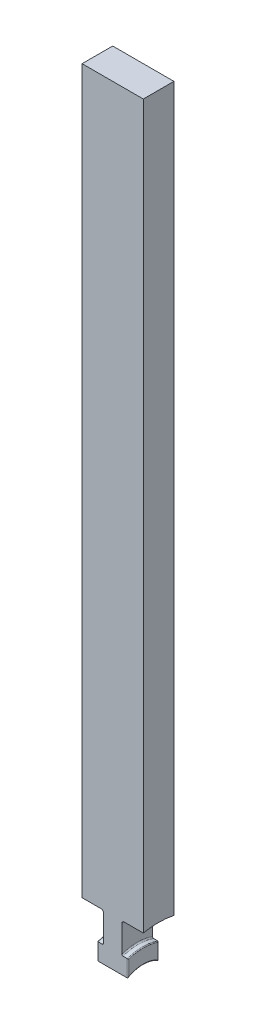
ISO-10303-21;
HEADER;
FILE_DESCRIPTION(('STEP AP214'),'2;1');
FILE_NAME('part.step','',(''),(''),'','','');
FILE_SCHEMA(('AUTOMOTIVE_DESIGN { 1 0 10303 214 1 1 1 1 }'));
ENDSEC;
DATA;
#1=APPLICATION_CONTEXT('core data for automotive mechanical design processes');
#2=APPLICATION_PROTOCOL_DEFINITION('international standard','automotive_design',2000,#1);
#3=PRODUCT_CONTEXT('',#1,'mechanical');
#4=PRODUCT('Part','Part','',(#3));
#5=PRODUCT_RELATED_PRODUCT_CATEGORY('part','',(#4));
#6=PRODUCT_DEFINITION_FORMATION('','',#4);
#7=PRODUCT_DEFINITION_CONTEXT('part definition',#1,'design');
#8=PRODUCT_DEFINITION('design','',#6,#7);
#9=PRODUCT_DEFINITION_SHAPE('','',#8);
#10=(LENGTH_UNIT() NAMED_UNIT(*) SI_UNIT(.MILLI.,.METRE.));
#11=(NAMED_UNIT(*) PLANE_ANGLE_UNIT() SI_UNIT($,.RADIAN.));
#12=(NAMED_UNIT(*) SI_UNIT($,.STERADIAN.) SOLID_ANGLE_UNIT());
#13=UNCERTAINTY_MEASURE_WITH_UNIT(LENGTH_MEASURE(1.E-05),#10,'distance_accuracy_value','');
#14=(GEOMETRIC_REPRESENTATION_CONTEXT(3) GLOBAL_UNCERTAINTY_ASSIGNED_CONTEXT((#13)) GLOBAL_UNIT_ASSIGNED_CONTEXT((#10,
#11,#12)) REPRESENTATION_CONTEXT('',''));
#15=CARTESIAN_POINT('',(0.,0.,0.));
#16=DIRECTION('',(0.,0.,1.));
#17=DIRECTION('',(1.,0.,0.));
#18=AXIS2_PLACEMENT_3D('',#15,#16,#17);
#19=CARTESIAN_POINT('',(10.,260.,5.));
#20=DIRECTION('',(0.,0.,-1.));
#21=DIRECTION('',(0.,1.,0.));
#22=AXIS2_PLACEMENT_3D('',#19,#20,#21);
#23=PLANE('',#22);
#24=DIRECTION('',(-1.,0.,0.));
#25=VECTOR('',#24,1.);
#26=CARTESIAN_POINT('',(-8.84822894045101,14.142135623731,4.99999999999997));
#27=LINE('',#26,#25);
#28=CARTESIAN_POINT('',(-4.75,14.142135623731,4.99999999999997));
#29=VERTEX_POINT('',#28);
#30=CARTESIAN_POINT('',(-3.381,14.142135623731,4.99999999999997));
#31=VERTEX_POINT('',#30);
#32=EDGE_CURVE('E731',#29,#31,#27,.F.);
#33=ORIENTED_EDGE('',*,*,#32,.F.);
#34=DIRECTION('',(0.,1.,0.));
#35=VECTOR('',#34,1.);
#36=CARTESIAN_POINT('',(-4.75000000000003,260.,5.));
#37=LINE('',#36,#35);
#38=CARTESIAN_POINT('',(-4.75,8.6602540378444,4.99999999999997));
#39=VERTEX_POINT('',#38);
#40=EDGE_CURVE('E442',#29,#39,#37,.F.);
#41=ORIENTED_EDGE('',*,*,#40,.T.);
#42=DIRECTION('',(1.,0.,0.));
#43=VECTOR('',#42,1.);
#44=CARTESIAN_POINT('',(-10.,8.6602540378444,4.99999999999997));
#45=LINE('',#44,#43);
#46=CARTESIAN_POINT('',(4.75,8.6602540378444,4.99999999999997));
#47=VERTEX_POINT('',#46);
#48=EDGE_CURVE('E212',#39,#47,#45,.T.);
#49=ORIENTED_EDGE('',*,*,#48,.T.);
#50=DIRECTION('',(0.,-1.,0.));
#51=VECTOR('',#50,1.);
#52=CARTESIAN_POINT('',(4.74999999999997,260.,5.));
#53=LINE('',#52,#51);
#54=CARTESIAN_POINT('',(4.75,14.142135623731,4.99999999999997));
#55=VERTEX_POINT('',#54);
#56=EDGE_CURVE('E440',#47,#55,#53,.F.);
#57=ORIENTED_EDGE('',*,*,#56,.T.);
#58=DIRECTION('',(-1.,0.,0.));
#59=VECTOR('',#58,1.);
#60=CARTESIAN_POINT('',(-8.84822894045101,14.142135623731,4.99999999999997));
#61=LINE('',#60,#59);
#62=CARTESIAN_POINT('',(3.381,14.142135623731,4.99999999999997));
#63=VERTEX_POINT('',#62);
#64=EDGE_CURVE('E734',#63,#55,#61,.F.);
#65=ORIENTED_EDGE('',*,*,#64,.F.);
#66=CARTESIAN_POINT('',(3.381,14.142135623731,4.99999999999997));
#67=CARTESIAN_POINT('',(3.36044101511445,14.1421123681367,4.99999999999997));
#68=CARTESIAN_POINT('',(3.33989480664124,14.1438990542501,4.99999999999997));
#69=CARTESIAN_POINT('',(3.29944640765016,14.150911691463,4.99999999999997));
#70=CARTESIAN_POINT('',(3.27954279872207,14.1561294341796,4.99999999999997));
#71=CARTESIAN_POINT('',(3.24089644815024,14.1698244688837,4.99999999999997));
#72=CARTESIAN_POINT('',(3.22215359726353,14.1783014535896,4.99999999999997));
#73=CARTESIAN_POINT('',(3.18630692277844,14.1982079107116,4.99999999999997));
#74=CARTESIAN_POINT('',(3.16920356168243,14.2096382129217,4.99999999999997));
#75=CARTESIAN_POINT('',(3.13665043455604,14.2353899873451,4.99999999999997));
#76=CARTESIAN_POINT('',(3.12125112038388,14.2497751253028,4.99999999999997));
#77=CARTESIAN_POINT('',(3.09293401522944,14.2808084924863,4.99999999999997));
#78=CARTESIAN_POINT('',(3.08001687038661,14.2974573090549,4.99999999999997));
#79=CARTESIAN_POINT('',(3.05629123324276,14.3335018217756,4.99999999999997));
#80=CARTESIAN_POINT('',(3.0456345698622,14.3529973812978,4.99999999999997));
#81=CARTESIAN_POINT('',(3.02756329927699,14.393438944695,4.99999999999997));
#82=CARTESIAN_POINT('',(3.02014920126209,14.4143851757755,4.99999999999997));
#83=CARTESIAN_POINT('',(3.00963126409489,14.4536794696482,4.99999999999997));
#84=CARTESIAN_POINT('',(3.00602178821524,14.4718944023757,4.99999999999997));
#85=CARTESIAN_POINT('',(3.00120597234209,14.5086131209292,4.99999999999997));
#86=CARTESIAN_POINT('',(2.99999624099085,14.5271164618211,4.99999999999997));
#87=CARTESIAN_POINT('',(3.,14.5456234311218,4.99999999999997));
#88=B_SPLINE_CURVE_WITH_KNOTS('',3,(#66,#67,#68,#69,#70,#71,#72,#73,#74,#75,#76,#77,#78,#79,#80,
#81,#82,#83,#84,#85,#86,#87),.UNSPECIFIED.,.F.,.F.,(4,2,2,2,2,2,2,2,2,2,4),(0.,
0.061579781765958,0.123012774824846,0.18443997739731,0.245884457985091,0.308826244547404,
0.371784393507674,0.438147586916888,0.504521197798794,0.560074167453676,0.615548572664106),.UNSPECIFIED.);
#89=CARTESIAN_POINT('',(3.,14.5456234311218,4.99999999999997));
#90=VERTEX_POINT('',#89);
#91=EDGE_CURVE('E312',#63,#90,#88,.T.);
#92=ORIENTED_EDGE('',*,*,#91,.T.);
#93=DIRECTION('',(0.,-1.,0.));
#94=VECTOR('',#93,1.);
#95=CARTESIAN_POINT('',(3.,260.,5.));
#96=LINE('',#95,#94);
#97=CARTESIAN_POINT('',(3.,23.2054442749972,4.99999999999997));
#98=VERTEX_POINT('',#97);
#99=EDGE_CURVE('E464',#98,#90,#96,.T.);
#100=ORIENTED_EDGE('',*,*,#99,.F.);
#101=CARTESIAN_POINT('',(3.,23.2054442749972,4.99999999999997));
#102=CARTESIAN_POINT('',(2.99996676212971,23.2499972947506,4.99999999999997));
#103=CARTESIAN_POINT('',(3.00373228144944,23.2945461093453,4.99999999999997));
#104=CARTESIAN_POINT('',(3.01862949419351,23.3823910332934,4.99999999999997));
#105=CARTESIAN_POINT('',(3.02976052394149,23.4256872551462,4.99999999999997));
#106=CARTESIAN_POINT('',(3.05916829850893,23.509822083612,4.99999999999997));
#107=CARTESIAN_POINT('',(3.07745028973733,23.5506588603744,4.99999999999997));
#108=CARTESIAN_POINT('',(3.12067837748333,23.6286229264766,4.99999999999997));
#109=CARTESIAN_POINT('',(3.14562195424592,23.6657516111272,4.99999999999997));
#110=CARTESIAN_POINT('',(3.2012013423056,23.7347915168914,4.99999999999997));
#111=CARTESIAN_POINT('',(3.23177053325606,23.7667563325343,4.99999999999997));
#112=CARTESIAN_POINT('',(3.29795305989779,23.8249730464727,4.99999999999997));
#113=CARTESIAN_POINT('',(3.33356714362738,23.8512240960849,4.99999999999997));
#114=CARTESIAN_POINT('',(3.40801970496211,23.8966720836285,4.99999999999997));
#115=CARTESIAN_POINT('',(3.44677552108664,23.9160046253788,4.99999999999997));
#116=CARTESIAN_POINT('',(3.5270132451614,23.9477326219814,4.99999999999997));
#117=CARTESIAN_POINT('',(3.56849266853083,23.9601343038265,4.99999999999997));
#118=CARTESIAN_POINT('',(3.63558702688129,23.9740235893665,4.99999999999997));
#119=CARTESIAN_POINT('',(3.66073087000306,23.9779013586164,4.99999999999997));
#120=CARTESIAN_POINT('',(3.71124579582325,23.9830736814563,4.99999999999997));
#121=CARTESIAN_POINT('',(3.7366164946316,23.9843719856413,4.99999999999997));
#122=CARTESIAN_POINT('',(3.762,23.9843699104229,4.99999999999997));
#123=B_SPLINE_CURVE_WITH_KNOTS('',3,(#101,#102,#103,#104,#105,#106,#107,#108,#109,#110,#111,
#112,#113,#114,#115,#116,#117,#118,#119,#120,#121,#122),.UNSPECIFIED.,.F.,.F.,(4,2,2,2,2,2,2,2,
2,2,4),(0.,0.133495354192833,0.266978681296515,0.40056012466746,0.53409111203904,
0.6661321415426,0.798192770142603,0.927501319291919,1.05669350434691,1.13289667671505,
1.20898896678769),.UNSPECIFIED.);
#124=CARTESIAN_POINT('',(3.762,23.9843699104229,4.99999999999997));
#125=VERTEX_POINT('',#124);
#126=EDGE_CURVE('E277',#98,#125,#123,.T.);
#127=ORIENTED_EDGE('',*,*,#126,.T.);
#128=DIRECTION('',(-1.,0.,0.));
#129=VECTOR('',#128,1.);
#130=CARTESIAN_POINT('',(-8.84822894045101,23.9843699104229,4.99999999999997));
#131=LINE('',#130,#129);
#132=CARTESIAN_POINT('',(10.,23.9843699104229,4.99999999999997));
#133=VERTEX_POINT('',#132);
#134=EDGE_CURVE('E741',#133,#125,#131,.T.);
#135=ORIENTED_EDGE('',*,*,#134,.F.);
#136=DIRECTION('',(0.,-1.,0.));
#137=VECTOR('',#136,1.);
#138=CARTESIAN_POINT('',(10.,260.,5.));
#139=LINE('',#138,#137);
#140=CARTESIAN_POINT('',(10.,260.,5.));
#141=VERTEX_POINT('',#140);
#142=EDGE_CURVE('E470',#141,#133,#139,.T.);
#143=ORIENTED_EDGE('',*,*,#142,.F.);
#144=DIRECTION('',(-1.,0.,0.));
#145=VECTOR('',#144,1.);
#146=CARTESIAN_POINT('',(10.,260.,5.));
#147=LINE('',#146,#145);
#148=CARTESIAN_POINT('',(-10.,260.,5.));
#149=VERTEX_POINT('',#148);
#150=EDGE_CURVE('E206',#141,#149,#147,.T.);
#151=ORIENTED_EDGE('',*,*,#150,.T.);
#152=DIRECTION('',(0.,-1.,0.));
#153=VECTOR('',#152,1.);
#154=CARTESIAN_POINT('',(-10.,260.,5.));
#155=LINE('',#154,#153);
#156=CARTESIAN_POINT('',(-10.,23.9843699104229,4.99999999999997));
#157=VERTEX_POINT('',#156);
#158=EDGE_CURVE('E198',#149,#157,#155,.T.);
#159=ORIENTED_EDGE('',*,*,#158,.T.);
#160=DIRECTION('',(-1.,0.,0.));
#161=VECTOR('',#160,1.);
#162=CARTESIAN_POINT('',(-8.84822894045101,23.9843699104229,4.99999999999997));
#163=LINE('',#162,#161);
#164=CARTESIAN_POINT('',(-3.762,23.9843699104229,4.99999999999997));
#165=VERTEX_POINT('',#164);
#166=EDGE_CURVE('E179',#165,#157,#163,.T.);
#167=ORIENTED_EDGE('',*,*,#166,.F.);
#168=CARTESIAN_POINT('',(-3.762,23.9843699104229,4.99999999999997));
#169=CARTESIAN_POINT('',(-3.71978958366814,23.9844099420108,4.99999999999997));
#170=CARTESIAN_POINT('',(-3.67759522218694,23.9807897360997,4.99999999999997));
#171=CARTESIAN_POINT('',(-3.59446661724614,23.9665304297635,4.99999999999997));
#172=CARTESIAN_POINT('',(-3.55353072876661,23.9559009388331,4.99999999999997));
#173=CARTESIAN_POINT('',(-3.47401404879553,23.9279192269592,4.99999999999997));
#174=CARTESIAN_POINT('',(-3.4354339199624,23.9105651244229,4.99999999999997));
#175=CARTESIAN_POINT('',(-3.36170074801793,23.8696860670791,4.99999999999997));
#176=CARTESIAN_POINT('',(-3.32654766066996,23.846161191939,4.99999999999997));
#177=CARTESIAN_POINT('',(-3.26030425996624,23.7934071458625,4.99999999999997));
#178=CARTESIAN_POINT('',(-3.22925316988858,23.7641287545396,4.99999999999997));
#179=CARTESIAN_POINT('',(-3.17238517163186,23.7008610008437,4.99999999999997));
#180=CARTESIAN_POINT('',(-3.14656943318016,23.6668705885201,4.99999999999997));
#181=CARTESIAN_POINT('',(-3.10035493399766,23.5944221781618,4.99999999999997));
#182=CARTESIAN_POINT('',(-3.0800757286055,23.5558879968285,4.99999999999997));
#183=CARTESIAN_POINT('',(-3.04613526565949,23.4760125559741,4.99999999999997));
#184=CARTESIAN_POINT('',(-3.03247223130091,23.4346720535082,4.99999999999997));
#185=CARTESIAN_POINT('',(-3.01487304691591,23.3618958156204,4.99999999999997));
#186=CARTESIAN_POINT('',(-3.0092983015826,23.3308452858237,4.99999999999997));
#187=CARTESIAN_POINT('',(-3.00186183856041,23.2683479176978,4.99999999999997));
#188=CARTESIAN_POINT('',(-2.9999948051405,23.2369017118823,4.99999999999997));
#189=CARTESIAN_POINT('',(-3.,23.2054442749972,4.99999999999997));
#190=B_SPLINE_CURVE_WITH_KNOTS('',3,(#168,#169,#170,#171,#172,#173,#174,#175,#176,#177,#178,
#179,#180,#181,#182,#183,#184,#185,#186,#187,#188,#189),.UNSPECIFIED.,.F.,.F.,(4,2,2,2,2,2,2,2,
2,2,4),(0.,0.126452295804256,0.25273158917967,0.379046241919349,0.50535926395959,
0.632804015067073,0.760277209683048,0.89031743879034,1.02032272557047,1.11475319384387,
1.20904817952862),.UNSPECIFIED.);
#191=CARTESIAN_POINT('',(-3.,23.2054442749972,4.99999999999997));
#192=VERTEX_POINT('',#191);
#193=EDGE_CURVE('E243',#165,#192,#190,.T.);
#194=ORIENTED_EDGE('',*,*,#193,.T.);
#195=DIRECTION('',(0.,1.,0.));
#196=VECTOR('',#195,1.);
#197=CARTESIAN_POINT('',(-3.,260.,5.));
#198=LINE('',#197,#196);
#199=CARTESIAN_POINT('',(-3.,14.5456234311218,4.99999999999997));
#200=VERTEX_POINT('',#199);
#201=EDGE_CURVE('E732',#200,#192,#198,.T.);
#202=ORIENTED_EDGE('',*,*,#201,.F.);
#203=CARTESIAN_POINT('',(-3.,14.5456234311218,4.99999999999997));
#204=CARTESIAN_POINT('',(-2.99998669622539,14.521929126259,4.99999999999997));
#205=CARTESIAN_POINT('',(-3.00197620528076,14.4982335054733,4.99999999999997));
#206=CARTESIAN_POINT('',(-3.00986486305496,14.4514801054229,4.99999999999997));
#207=CARTESIAN_POINT('',(-3.01576760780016,14.4284229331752,4.99999999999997));
#208=CARTESIAN_POINT('',(-3.03139415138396,14.3836107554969,4.99999999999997));
#209=CARTESIAN_POINT('',(-3.04112173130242,14.3618570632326,4.99999999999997));
#210=CARTESIAN_POINT('',(-3.06418438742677,14.3203644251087,4.99999999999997));
#211=CARTESIAN_POINT('',(-3.07751717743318,14.3006242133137,4.99999999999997));
#212=CARTESIAN_POINT('',(-3.10707013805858,14.2643232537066,4.99999999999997));
#213=CARTESIAN_POINT('',(-3.12320168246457,14.2476904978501,4.99999999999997));
#214=CARTESIAN_POINT('',(-3.15817938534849,14.2175591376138,4.99999999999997));
#215=CARTESIAN_POINT('',(-3.17702556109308,14.2040605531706,4.99999999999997));
#216=CARTESIAN_POINT('',(-3.21576938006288,14.1813954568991,4.99999999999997));
#217=CARTESIAN_POINT('',(-3.23555118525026,14.1720306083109,4.99999999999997));
#218=CARTESIAN_POINT('',(-3.27645260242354,14.1569716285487,4.99999999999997));
#219=CARTESIAN_POINT('',(-3.29757019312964,14.1512720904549,4.99999999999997));
#220=CARTESIAN_POINT('',(-3.32924424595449,14.145729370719,4.99999999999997));
#221=CARTESIAN_POINT('',(-3.33955687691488,14.1443822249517,4.99999999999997));
#222=CARTESIAN_POINT('',(-3.36024450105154,14.1425859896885,4.99999999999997));
#223=CARTESIAN_POINT('',(-3.37061937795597,14.1421355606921,4.99999999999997));
#224=CARTESIAN_POINT('',(-3.38099999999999,14.1421356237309,4.99999999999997));
#225=B_SPLINE_CURVE_WITH_KNOTS('',3,(#203,#204,#205,#206,#207,#208,#209,#210,#211,#212,#213,
#214,#215,#216,#217,#218,#219,#220,#221,#222,#223,#224),.UNSPECIFIED.,.F.,.F.,(4,2,2,2,2,2,2,2,
2,2,4),(0.,0.0710029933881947,0.14207132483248,0.213210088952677,0.284303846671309,
0.353459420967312,0.422615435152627,0.487945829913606,0.553179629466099,0.584346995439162,
0.615467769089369),.UNSPECIFIED.);
#226=EDGE_CURVE('E292',#200,#31,#225,.T.);
#227=ORIENTED_EDGE('',*,*,#226,.T.);
#228=EDGE_LOOP('',(#33,#41,#49,#57,#65,#92,#100,#127,#135,#143,#151,#159,#167,#194,#202,#227));
#229=FACE_BOUND('',#228,.T.);
#230=ADVANCED_FACE('F37',(#229),#23,.F.);
#231=CARTESIAN_POINT('',(10.,260.,-5.));
#232=DIRECTION('',(0.,0.,1.));
#233=DIRECTION('',(0.,-1.,0.));
#234=AXIS2_PLACEMENT_3D('',#231,#232,#233);
#235=PLANE('',#234);
#236=DIRECTION('',(1.,0.,0.));
#237=VECTOR('',#236,1.);
#238=CARTESIAN_POINT('',(-10.,8.66025403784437,-5.00000000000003));
#239=LINE('',#238,#237);
#240=CARTESIAN_POINT('',(4.75,8.66025403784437,-5.00000000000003));
#241=VERTEX_POINT('',#240);
#242=CARTESIAN_POINT('',(-4.75,8.66025403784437,-5.00000000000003));
#243=VERTEX_POINT('',#242);
#244=EDGE_CURVE('E462',#241,#243,#239,.F.);
#245=ORIENTED_EDGE('',*,*,#244,.T.);
#246=DIRECTION('',(0.,1.,0.));
#247=VECTOR('',#246,1.);
#248=CARTESIAN_POINT('',(-4.75000000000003,260.,-5.));
#249=LINE('',#248,#247);
#250=CARTESIAN_POINT('',(-4.75,14.1421356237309,-5.00000000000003));
#251=VERTEX_POINT('',#250);
#252=EDGE_CURVE('E432',#243,#251,#249,.T.);
#253=ORIENTED_EDGE('',*,*,#252,.T.);
#254=DIRECTION('',(-1.,0.,0.));
#255=VECTOR('',#254,1.);
#256=CARTESIAN_POINT('',(-8.84822894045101,14.1421356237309,-5.00000000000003));
#257=LINE('',#256,#255);
#258=CARTESIAN_POINT('',(-3.381,14.1421356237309,-5.00000000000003));
#259=VERTEX_POINT('',#258);
#260=EDGE_CURVE('E747',#259,#251,#257,.T.);
#261=ORIENTED_EDGE('',*,*,#260,.F.);
#262=CARTESIAN_POINT('',(-3.381,14.1421356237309,-5.00000000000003));
#263=CARTESIAN_POINT('',(-3.36044101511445,14.1421123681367,-5.00000000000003));
#264=CARTESIAN_POINT('',(-3.33989480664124,14.1438990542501,-5.00000000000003));
#265=CARTESIAN_POINT('',(-3.29944640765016,14.150911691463,-5.00000000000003));
#266=CARTESIAN_POINT('',(-3.27954279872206,14.1561294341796,-5.00000000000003));
#267=CARTESIAN_POINT('',(-3.24089644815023,14.1698244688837,-5.00000000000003));
#268=CARTESIAN_POINT('',(-3.22215359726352,14.1783014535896,-5.00000000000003));
#269=CARTESIAN_POINT('',(-3.18630692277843,14.1982079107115,-5.00000000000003));
#270=CARTESIAN_POINT('',(-3.16920356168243,14.2096382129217,-5.00000000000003));
#271=CARTESIAN_POINT('',(-3.13665043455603,14.2353899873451,-5.00000000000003));
#272=CARTESIAN_POINT('',(-3.12125112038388,14.2497751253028,-5.00000000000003));
#273=CARTESIAN_POINT('',(-3.09293401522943,14.2808084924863,-5.00000000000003));
#274=CARTESIAN_POINT('',(-3.08001687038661,14.2974573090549,-5.00000000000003));
#275=CARTESIAN_POINT('',(-3.05629123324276,14.3335018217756,-5.00000000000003));
#276=CARTESIAN_POINT('',(-3.0456345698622,14.3529973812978,-5.00000000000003));
#277=CARTESIAN_POINT('',(-3.02756329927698,14.3934389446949,-5.00000000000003));
#278=CARTESIAN_POINT('',(-3.02014920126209,14.4143851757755,-5.00000000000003));
#279=CARTESIAN_POINT('',(-3.00963126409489,14.4536794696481,-5.00000000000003));
#280=CARTESIAN_POINT('',(-3.00602178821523,14.4718944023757,-5.00000000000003));
#281=CARTESIAN_POINT('',(-3.00120597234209,14.5086131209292,-5.00000000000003));
#282=CARTESIAN_POINT('',(-2.99999624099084,14.5271164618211,-5.00000000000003));
#283=CARTESIAN_POINT('',(-3.,14.5456234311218,-5.00000000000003));
#284=B_SPLINE_CURVE_WITH_KNOTS('',3,(#262,#263,#264,#265,#266,#267,#268,#269,#270,#271,#272,
#273,#274,#275,#276,#277,#278,#279,#280,#281,#282,#283),.UNSPECIFIED.,.F.,.F.,(4,2,2,2,2,2,2,2,
2,2,4),(0.,0.0615797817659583,0.123012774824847,0.184439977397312,0.245884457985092,
0.308826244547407,0.371784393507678,0.43814758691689,0.504521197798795,0.56007416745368,
0.615548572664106),.UNSPECIFIED.);
#285=CARTESIAN_POINT('',(-3.,14.5456234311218,-5.00000000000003));
#286=VERTEX_POINT('',#285);
#287=EDGE_CURVE('E301',#259,#286,#284,.T.);
#288=ORIENTED_EDGE('',*,*,#287,.T.);
#289=DIRECTION('',(0.,-1.,0.));
#290=VECTOR('',#289,1.);
#291=CARTESIAN_POINT('',(-3.,260.,-5.));
#292=LINE('',#291,#290);
#293=CARTESIAN_POINT('',(-3.,23.2054442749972,-5.00000000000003));
#294=VERTEX_POINT('',#293);
#295=EDGE_CURVE('E221',#294,#286,#292,.T.);
#296=ORIENTED_EDGE('',*,*,#295,.F.);
#297=CARTESIAN_POINT('',(-3.,23.2054442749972,-5.00000000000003));
#298=CARTESIAN_POINT('',(-2.99996676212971,23.2499972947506,-5.00000000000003));
#299=CARTESIAN_POINT('',(-3.00373228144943,23.2945461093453,-5.00000000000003));
#300=CARTESIAN_POINT('',(-3.01862949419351,23.3823910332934,-5.00000000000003));
#301=CARTESIAN_POINT('',(-3.02976052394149,23.4256872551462,-5.00000000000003));
#302=CARTESIAN_POINT('',(-3.05916829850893,23.509822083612,-5.00000000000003));
#303=CARTESIAN_POINT('',(-3.07745028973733,23.5506588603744,-5.00000000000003));
#304=CARTESIAN_POINT('',(-3.12067837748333,23.6286229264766,-5.00000000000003));
#305=CARTESIAN_POINT('',(-3.14562195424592,23.6657516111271,-5.00000000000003));
#306=CARTESIAN_POINT('',(-3.2012013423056,23.7347915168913,-5.00000000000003));
#307=CARTESIAN_POINT('',(-3.23177053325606,23.7667563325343,-5.00000000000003));
#308=CARTESIAN_POINT('',(-3.29795305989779,23.8249730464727,-5.00000000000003));
#309=CARTESIAN_POINT('',(-3.33356714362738,23.8512240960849,-5.00000000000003));
#310=CARTESIAN_POINT('',(-3.40801970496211,23.8966720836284,-5.00000000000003));
#311=CARTESIAN_POINT('',(-3.44677552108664,23.9160046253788,-5.00000000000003));
#312=CARTESIAN_POINT('',(-3.5270132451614,23.9477326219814,-5.00000000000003));
#313=CARTESIAN_POINT('',(-3.56849266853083,23.9601343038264,-5.00000000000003));
#314=CARTESIAN_POINT('',(-3.63558702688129,23.9740235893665,-5.00000000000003));
#315=CARTESIAN_POINT('',(-3.66073087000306,23.9779013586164,-5.00000000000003));
#316=CARTESIAN_POINT('',(-3.71124579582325,23.9830736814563,-5.00000000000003));
#317=CARTESIAN_POINT('',(-3.7366164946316,23.9843719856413,-5.00000000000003));
#318=CARTESIAN_POINT('',(-3.762,23.9843699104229,-5.00000000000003));
#319=B_SPLINE_CURVE_WITH_KNOTS('',3,(#297,#298,#299,#300,#301,#302,#303,#304,#305,#306,#307,
#308,#309,#310,#311,#312,#313,#314,#315,#316,#317,#318),.UNSPECIFIED.,.F.,.F.,(4,2,2,2,2,2,2,2,
2,2,4),(0.,0.133495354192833,0.266978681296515,0.400560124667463,0.53409111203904,
0.666132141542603,0.798192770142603,0.927501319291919,1.05669350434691,1.13289667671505,
1.20898896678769),.UNSPECIFIED.);
#320=CARTESIAN_POINT('',(-3.762,23.9843699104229,-5.00000000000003));
#321=VERTEX_POINT('',#320);
#322=EDGE_CURVE('E235',#294,#321,#319,.T.);
#323=ORIENTED_EDGE('',*,*,#322,.T.);
#324=DIRECTION('',(-1.,0.,0.));
#325=VECTOR('',#324,1.);
#326=CARTESIAN_POINT('',(-8.84822894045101,23.9843699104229,-5.00000000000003));
#327=LINE('',#326,#325);
#328=CARTESIAN_POINT('',(-10.,23.9843699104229,-5.00000000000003));
#329=VERTEX_POINT('',#328);
#330=EDGE_CURVE('E192',#329,#321,#327,.F.);
#331=ORIENTED_EDGE('',*,*,#330,.F.);
#332=DIRECTION('',(0.,1.,0.));
#333=VECTOR('',#332,1.);
#334=CARTESIAN_POINT('',(-10.,260.,-5.));
#335=LINE('',#334,#333);
#336=CARTESIAN_POINT('',(-10.,260.,-5.));
#337=VERTEX_POINT('',#336);
#338=EDGE_CURVE('E200',#329,#337,#335,.T.);
#339=ORIENTED_EDGE('',*,*,#338,.T.);
#340=DIRECTION('',(-1.,0.,0.));
#341=VECTOR('',#340,1.);
#342=CARTESIAN_POINT('',(10.,260.,-5.));
#343=LINE('',#342,#341);
#344=CARTESIAN_POINT('',(10.,260.,-5.));
#345=VERTEX_POINT('',#344);
#346=EDGE_CURVE('E216',#345,#337,#343,.T.);
#347=ORIENTED_EDGE('',*,*,#346,.F.);
#348=DIRECTION('',(0.,1.,0.));
#349=VECTOR('',#348,1.);
#350=CARTESIAN_POINT('',(10.,260.,-5.));
#351=LINE('',#350,#349);
#352=CARTESIAN_POINT('',(10.,23.9843699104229,-5.00000000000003));
#353=VERTEX_POINT('',#352);
#354=EDGE_CURVE('E219',#353,#345,#351,.T.);
#355=ORIENTED_EDGE('',*,*,#354,.F.);
#356=DIRECTION('',(-1.,0.,0.));
#357=VECTOR('',#356,1.);
#358=CARTESIAN_POINT('',(-8.84822894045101,23.9843699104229,-5.00000000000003));
#359=LINE('',#358,#357);
#360=CARTESIAN_POINT('',(3.762,23.9843699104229,-5.00000000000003));
#361=VERTEX_POINT('',#360);
#362=EDGE_CURVE('E191',#361,#353,#359,.F.);
#363=ORIENTED_EDGE('',*,*,#362,.F.);
#364=CARTESIAN_POINT('',(3.762,23.9843699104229,-5.00000000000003));
#365=CARTESIAN_POINT('',(3.71978958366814,23.9844099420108,-5.00000000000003));
#366=CARTESIAN_POINT('',(3.67759522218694,23.9807897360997,-5.00000000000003));
#367=CARTESIAN_POINT('',(3.59446661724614,23.9665304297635,-5.00000000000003));
#368=CARTESIAN_POINT('',(3.55353072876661,23.9559009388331,-5.00000000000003));
#369=CARTESIAN_POINT('',(3.47401404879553,23.9279192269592,-5.00000000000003));
#370=CARTESIAN_POINT('',(3.4354339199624,23.9105651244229,-5.00000000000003));
#371=CARTESIAN_POINT('',(3.36170074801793,23.869686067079,-5.00000000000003));
#372=CARTESIAN_POINT('',(3.32654766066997,23.846161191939,-5.00000000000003));
#373=CARTESIAN_POINT('',(3.26030425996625,23.7934071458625,-5.00000000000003));
#374=CARTESIAN_POINT('',(3.22925316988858,23.7641287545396,-5.00000000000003));
#375=CARTESIAN_POINT('',(3.17238517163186,23.7008610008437,-5.00000000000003));
#376=CARTESIAN_POINT('',(3.14656943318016,23.6668705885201,-5.00000000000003));
#377=CARTESIAN_POINT('',(3.10035493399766,23.5944221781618,-5.00000000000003));
#378=CARTESIAN_POINT('',(3.0800757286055,23.5558879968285,-5.00000000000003));
#379=CARTESIAN_POINT('',(3.04613526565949,23.4760125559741,-5.00000000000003));
#380=CARTESIAN_POINT('',(3.03247223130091,23.4346720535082,-5.00000000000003));
#381=CARTESIAN_POINT('',(3.01487304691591,23.3618958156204,-5.00000000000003));
#382=CARTESIAN_POINT('',(3.0092983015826,23.3308452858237,-5.00000000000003));
#383=CARTESIAN_POINT('',(3.00186183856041,23.2683479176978,-5.00000000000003));
#384=CARTESIAN_POINT('',(2.9999948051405,23.2369017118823,-5.00000000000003));
#385=CARTESIAN_POINT('',(3.,23.2054442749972,-5.00000000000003));
#386=B_SPLINE_CURVE_WITH_KNOTS('',3,(#364,#365,#366,#367,#368,#369,#370,#371,#372,#373,#374,
#375,#376,#377,#378,#379,#380,#381,#382,#383,#384,#385),.UNSPECIFIED.,.F.,.F.,(4,2,2,2,2,2,2,2,
2,2,4),(0.,0.126452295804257,0.252731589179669,0.379046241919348,0.505359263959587,
0.63280401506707,0.760277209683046,0.890317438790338,1.02032272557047,1.11475319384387,
1.20904817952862),.UNSPECIFIED.);
#387=CARTESIAN_POINT('',(3.,23.2054442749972,-5.00000000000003));
#388=VERTEX_POINT('',#387);
#389=EDGE_CURVE('E271',#361,#388,#386,.T.);
#390=ORIENTED_EDGE('',*,*,#389,.T.);
#391=DIRECTION('',(0.,1.,0.));
#392=VECTOR('',#391,1.);
#393=CARTESIAN_POINT('',(3.,260.,-5.));
#394=LINE('',#393,#392);
#395=CARTESIAN_POINT('',(3.,14.5456234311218,-5.00000000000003));
#396=VERTEX_POINT('',#395);
#397=EDGE_CURVE('E224',#396,#388,#394,.T.);
#398=ORIENTED_EDGE('',*,*,#397,.F.);
#399=CARTESIAN_POINT('',(3.,14.5456234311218,-5.00000000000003));
#400=CARTESIAN_POINT('',(2.9999866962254,14.521929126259,-5.00000000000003));
#401=CARTESIAN_POINT('',(3.00197620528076,14.4982335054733,-5.00000000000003));
#402=CARTESIAN_POINT('',(3.00986486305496,14.4514801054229,-5.00000000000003));
#403=CARTESIAN_POINT('',(3.01576760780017,14.4284229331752,-5.00000000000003));
#404=CARTESIAN_POINT('',(3.03139415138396,14.3836107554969,-5.00000000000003));
#405=CARTESIAN_POINT('',(3.04112173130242,14.3618570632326,-5.00000000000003));
#406=CARTESIAN_POINT('',(3.06418438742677,14.3203644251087,-5.00000000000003));
#407=CARTESIAN_POINT('',(3.07751717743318,14.3006242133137,-5.00000000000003));
#408=CARTESIAN_POINT('',(3.10707013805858,14.2643232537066,-5.00000000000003));
#409=CARTESIAN_POINT('',(3.12320168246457,14.2476904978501,-5.00000000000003));
#410=CARTESIAN_POINT('',(3.1581793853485,14.2175591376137,-5.00000000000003));
#411=CARTESIAN_POINT('',(3.17702556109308,14.2040605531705,-5.00000000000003));
#412=CARTESIAN_POINT('',(3.21576938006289,14.1813954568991,-5.00000000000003));
#413=CARTESIAN_POINT('',(3.23555118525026,14.1720306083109,-5.00000000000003));
#414=CARTESIAN_POINT('',(3.27645260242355,14.1569716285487,-5.00000000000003));
#415=CARTESIAN_POINT('',(3.29757019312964,14.1512720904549,-5.00000000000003));
#416=CARTESIAN_POINT('',(3.3292442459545,14.145729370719,-5.00000000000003));
#417=CARTESIAN_POINT('',(3.33955687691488,14.1443822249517,-5.00000000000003));
#418=CARTESIAN_POINT('',(3.36024450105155,14.1425859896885,-5.00000000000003));
#419=CARTESIAN_POINT('',(3.37061937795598,14.1421355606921,-5.00000000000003));
#420=CARTESIAN_POINT('',(3.38099999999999,14.1421356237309,-5.00000000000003));
#421=B_SPLINE_CURVE_WITH_KNOTS('',3,(#399,#400,#401,#402,#403,#404,#405,#406,#407,#408,#409,
#410,#411,#412,#413,#414,#415,#416,#417,#418,#419,#420),.UNSPECIFIED.,.F.,.F.,(4,2,2,2,2,2,2,2,
2,2,4),(0.,0.0710029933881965,0.14207132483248,0.213210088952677,0.284303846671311,
0.353459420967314,0.422615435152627,0.487945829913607,0.553179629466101,0.584346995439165,
0.615467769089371),.UNSPECIFIED.);
#422=CARTESIAN_POINT('',(3.381,14.1421356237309,-5.00000000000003));
#423=VERTEX_POINT('',#422);
#424=EDGE_CURVE('E300',#396,#423,#421,.T.);
#425=ORIENTED_EDGE('',*,*,#424,.T.);
#426=DIRECTION('',(-1.,0.,0.));
#427=VECTOR('',#426,1.);
#428=CARTESIAN_POINT('',(-8.84822894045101,14.1421356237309,-5.00000000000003));
#429=LINE('',#428,#427);
#430=CARTESIAN_POINT('',(4.75,14.1421356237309,-5.00000000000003));
#431=VERTEX_POINT('',#430);
#432=EDGE_CURVE('E737',#431,#423,#429,.T.);
#433=ORIENTED_EDGE('',*,*,#432,.F.);
#434=DIRECTION('',(0.,-1.,0.));
#435=VECTOR('',#434,1.);
#436=CARTESIAN_POINT('',(4.74999999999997,260.,-5.));
#437=LINE('',#436,#435);
#438=EDGE_CURVE('E407',#431,#241,#437,.T.);
#439=ORIENTED_EDGE('',*,*,#438,.T.);
#440=EDGE_LOOP('',(#245,#253,#261,#288,#296,#323,#331,#339,#347,#355,#363,#390,#398,#425,#433,#439));
#441=FACE_BOUND('',#440,.T.);
#442=ADVANCED_FACE('F250',(#441),#235,.F.);
#443=CARTESIAN_POINT('',(-10.,0.,0.));
#444=DIRECTION('',(-1.,0.,0.));
#445=DIRECTION('',(0.,0.,1.));
#446=AXIS2_PLACEMENT_3D('',#443,#444,#445);
#447=PLANE('',#446);
#448=ORIENTED_EDGE('',*,*,#338,.F.);
#449=CARTESIAN_POINT('',(-10.,0.,0.));
#450=DIRECTION('',(-1.,0.,0.));
#451=DIRECTION('',(0.,0.,1.));
#452=AXIS2_PLACEMENT_3D('',#449,#450,#451);
#453=CIRCLE('',#452,24.5);
#454=EDGE_CURVE('E183',#157,#329,#453,.T.);
#455=ORIENTED_EDGE('',*,*,#454,.F.);
#456=ORIENTED_EDGE('',*,*,#158,.F.);
#457=DIRECTION('',(0.,0.,1.));
#458=VECTOR('',#457,1.);
#459=CARTESIAN_POINT('',(-10.,260.,5.));
#460=LINE('',#459,#458);
#461=EDGE_CURVE('E208',#337,#149,#460,.T.);
#462=ORIENTED_EDGE('',*,*,#461,.F.);
#463=EDGE_LOOP('',(#448,#455,#456,#462));
#464=FACE_BOUND('',#463,.T.);
#465=ADVANCED_FACE('F196',(#464),#447,.T.);
#466=CARTESIAN_POINT('',(10.,260.,5.));
#467=DIRECTION('',(0.,-1.,0.));
#468=DIRECTION('',(0.,0.,-1.));
#469=AXIS2_PLACEMENT_3D('',#466,#467,#468);
#470=PLANE('',#469);
#471=ORIENTED_EDGE('',*,*,#461,.T.);
#472=ORIENTED_EDGE('',*,*,#150,.F.);
#473=DIRECTION('',(0.,0.,1.));
#474=VECTOR('',#473,1.);
#475=CARTESIAN_POINT('',(10.,260.,5.));
#476=LINE('',#475,#474);
#477=EDGE_CURVE('E210',#345,#141,#476,.T.);
#478=ORIENTED_EDGE('',*,*,#477,.F.);
#479=ORIENTED_EDGE('',*,*,#346,.T.);
#480=EDGE_LOOP('',(#471,#472,#478,#479));
#481=FACE_BOUND('',#480,.T.);
#482=ADVANCED_FACE('F261',(#481),#470,.F.);
#483=CARTESIAN_POINT('',(10.,0.,0.));
#484=DIRECTION('',(-1.,0.,0.));
#485=DIRECTION('',(0.,0.,1.));
#486=AXIS2_PLACEMENT_3D('',#483,#484,#485);
#487=PLANE('',#486);
#488=CARTESIAN_POINT('',(10.,0.,0.));
#489=DIRECTION('',(-1.,0.,0.));
#490=DIRECTION('',(0.,0.,1.));
#491=AXIS2_PLACEMENT_3D('',#488,#489,#490);
#492=CIRCLE('',#491,24.5);
#493=EDGE_CURVE('E201',#133,#353,#492,.T.);
#494=ORIENTED_EDGE('',*,*,#493,.T.);
#495=ORIENTED_EDGE('',*,*,#354,.T.);
#496=ORIENTED_EDGE('',*,*,#477,.T.);
#497=ORIENTED_EDGE('',*,*,#142,.T.);
#498=EDGE_LOOP('',(#494,#495,#496,#497));
#499=FACE_BOUND('',#498,.T.);
#500=ADVANCED_FACE('F476',(#499),#487,.F.);
#501=CARTESIAN_POINT('',(-10.,0.,0.));
#502=DIRECTION('',(1.,0.,0.));
#503=DIRECTION('',(0.,0.,-1.));
#504=AXIS2_PLACEMENT_3D('',#501,#502,#503);
#505=CYLINDRICAL_SURFACE('',#504,10.);
#506=ORIENTED_EDGE('',*,*,#48,.F.);
#507=CARTESIAN_POINT('',(-4.75,0.,0.));
#508=DIRECTION('',(1.,0.,0.));
#509=DIRECTION('',(0.,1.,0.));
#510=AXIS2_PLACEMENT_3D('',#507,#508,#509);
#511=CIRCLE('',#510,10.);
#512=EDGE_CURVE('E419',#39,#243,#511,.F.);
#513=ORIENTED_EDGE('',*,*,#512,.T.);
#514=ORIENTED_EDGE('',*,*,#244,.F.);
#515=CARTESIAN_POINT('',(4.75,0.,0.));
#516=DIRECTION('',(-1.,0.,0.));
#517=DIRECTION('',(0.,-1.,0.));
#518=AXIS2_PLACEMENT_3D('',#515,#516,#517);
#519=CIRCLE('',#518,10.);
#520=EDGE_CURVE('E459',#241,#47,#519,.F.);
#521=ORIENTED_EDGE('',*,*,#520,.T.);
#522=EDGE_LOOP('',(#506,#513,#514,#521));
#523=FACE_BOUND('',#522,.T.);
#524=ADVANCED_FACE('F460',(#523),#505,.F.);
#525=CARTESIAN_POINT('',(-3.,15.,0.));
#526=DIRECTION('',(-1.,0.,0.));
#527=DIRECTION('',(0.,0.,1.));
#528=AXIS2_PLACEMENT_3D('',#525,#526,#527);
#529=PLANE('',#528);
#530=ORIENTED_EDGE('',*,*,#295,.T.);
#531=CARTESIAN_POINT('',(-3.,0.,0.));
#532=DIRECTION('',(-1.,0.,0.));
#533=DIRECTION('',(0.,0.,1.));
#534=AXIS2_PLACEMENT_3D('',#531,#532,#533);
#535=CIRCLE('',#534,15.381);
#536=EDGE_CURVE('E728',#286,#200,#535,.F.);
#537=ORIENTED_EDGE('',*,*,#536,.T.);
#538=ORIENTED_EDGE('',*,*,#201,.T.);
#539=CARTESIAN_POINT('',(-3.,0.,0.));
#540=DIRECTION('',(-1.,0.,0.));
#541=DIRECTION('',(0.,0.,1.));
#542=AXIS2_PLACEMENT_3D('',#539,#540,#541);
#543=CIRCLE('',#542,23.738);
#544=EDGE_CURVE('E226',#192,#294,#543,.T.);
#545=ORIENTED_EDGE('',*,*,#544,.T.);
#546=EDGE_LOOP('',(#530,#537,#538,#545));
#547=FACE_BOUND('',#546,.T.);
#548=ADVANCED_FACE('F493',(#547),#529,.T.);
#549=CARTESIAN_POINT('',(-8.84822894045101,0.,0.));
#550=DIRECTION('',(-1.,0.,0.));
#551=DIRECTION('',(0.,0.,1.));
#552=AXIS2_PLACEMENT_3D('',#549,#550,#551);
#553=CYLINDRICAL_SURFACE('',#552,24.5);
#554=ORIENTED_EDGE('',*,*,#330,.T.);
#555=CARTESIAN_POINT('',(-3.762,0.,0.));
#556=DIRECTION('',(-1.,0.,0.));
#557=DIRECTION('',(0.,0.,1.));
#558=AXIS2_PLACEMENT_3D('',#555,#556,#557);
#559=CIRCLE('',#558,24.5);
#560=EDGE_CURVE('E186',#321,#165,#559,.F.);
#561=ORIENTED_EDGE('',*,*,#560,.T.);
#562=ORIENTED_EDGE('',*,*,#166,.T.);
#563=ORIENTED_EDGE('',*,*,#454,.T.);
#564=EDGE_LOOP('',(#554,#561,#562,#563));
#565=FACE_BOUND('',#564,.T.);
#566=ADVANCED_FACE('F182',(#565),#553,.F.);
#567=CARTESIAN_POINT('',(-8.84822894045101,0.,0.));
#568=DIRECTION('',(-1.,0.,0.));
#569=DIRECTION('',(0.,0.,1.));
#570=AXIS2_PLACEMENT_3D('',#567,#568,#569);
#571=CYLINDRICAL_SURFACE('',#570,15.);
#572=ORIENTED_EDGE('',*,*,#260,.T.);
#573=CARTESIAN_POINT('',(-4.75,0.,0.));
#574=DIRECTION('',(1.,0.,0.));
#575=DIRECTION('',(0.,1.,0.));
#576=AXIS2_PLACEMENT_3D('',#573,#574,#575);
#577=CIRCLE('',#576,15.);
#578=EDGE_CURVE('E438',#251,#29,#577,.T.);
#579=ORIENTED_EDGE('',*,*,#578,.T.);
#580=ORIENTED_EDGE('',*,*,#32,.T.);
#581=CARTESIAN_POINT('',(-3.381,0.,0.));
#582=DIRECTION('',(-1.,0.,0.));
#583=DIRECTION('',(0.,0.,1.));
#584=AXIS2_PLACEMENT_3D('',#581,#582,#583);
#585=CIRCLE('',#584,15.);
#586=EDGE_CURVE('E283',#31,#259,#585,.T.);
#587=ORIENTED_EDGE('',*,*,#586,.T.);
#588=EDGE_LOOP('',(#572,#579,#580,#587));
#589=FACE_BOUND('',#588,.T.);
#590=ADVANCED_FACE('F496',(#589),#571,.T.);
#591=CARTESIAN_POINT('',(3.,15.,0.));
#592=DIRECTION('',(1.,0.,0.));
#593=DIRECTION('',(0.,0.,-1.));
#594=AXIS2_PLACEMENT_3D('',#591,#592,#593);
#595=PLANE('',#594);
#596=ORIENTED_EDGE('',*,*,#99,.T.);
#597=CARTESIAN_POINT('',(3.,0.,0.));
#598=DIRECTION('',(1.,0.,0.));
#599=DIRECTION('',(0.,0.,-1.));
#600=AXIS2_PLACEMENT_3D('',#597,#598,#599);
#601=CIRCLE('',#600,15.381);
#602=EDGE_CURVE('E762',#90,#396,#601,.F.);
#603=ORIENTED_EDGE('',*,*,#602,.T.);
#604=ORIENTED_EDGE('',*,*,#397,.T.);
#605=CARTESIAN_POINT('',(3.,0.,0.));
#606=DIRECTION('',(1.,0.,0.));
#607=DIRECTION('',(0.,0.,-1.));
#608=AXIS2_PLACEMENT_3D('',#605,#606,#607);
#609=CIRCLE('',#608,23.738);
#610=EDGE_CURVE('E233',#388,#98,#609,.T.);
#611=ORIENTED_EDGE('',*,*,#610,.T.);
#612=EDGE_LOOP('',(#596,#603,#604,#611));
#613=FACE_BOUND('',#612,.T.);
#614=ADVANCED_FACE('F499',(#613),#595,.T.);
#615=CARTESIAN_POINT('',(-8.84822894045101,0.,0.));
#616=DIRECTION('',(-1.,0.,0.));
#617=DIRECTION('',(0.,0.,1.));
#618=AXIS2_PLACEMENT_3D('',#615,#616,#617);
#619=CYLINDRICAL_SURFACE('',#618,15.);
#620=ORIENTED_EDGE('',*,*,#64,.T.);
#621=CARTESIAN_POINT('',(4.75,0.,0.));
#622=DIRECTION('',(-1.,0.,0.));
#623=DIRECTION('',(0.,-1.,0.));
#624=AXIS2_PLACEMENT_3D('',#621,#622,#623);
#625=CIRCLE('',#624,15.);
#626=EDGE_CURVE('E11',#55,#431,#625,.T.);
#627=ORIENTED_EDGE('',*,*,#626,.T.);
#628=ORIENTED_EDGE('',*,*,#432,.T.);
#629=CARTESIAN_POINT('',(3.381,0.,0.));
#630=DIRECTION('',(1.,0.,0.));
#631=DIRECTION('',(0.,0.,-1.));
#632=AXIS2_PLACEMENT_3D('',#629,#630,#631);
#633=CIRCLE('',#632,15.);
#634=EDGE_CURVE('E757',#423,#63,#633,.T.);
#635=ORIENTED_EDGE('',*,*,#634,.T.);
#636=EDGE_LOOP('',(#620,#627,#628,#635));
#637=FACE_BOUND('',#636,.T.);
#638=ADVANCED_FACE('F504',(#637),#619,.T.);
#639=CARTESIAN_POINT('',(-8.84822894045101,0.,0.));
#640=DIRECTION('',(-1.,0.,0.));
#641=DIRECTION('',(0.,0.,1.));
#642=AXIS2_PLACEMENT_3D('',#639,#640,#641);
#643=CYLINDRICAL_SURFACE('',#642,24.5);
#644=ORIENTED_EDGE('',*,*,#134,.T.);
#645=CARTESIAN_POINT('',(3.762,0.,0.));
#646=DIRECTION('',(1.,0.,0.));
#647=DIRECTION('',(0.,0.,-1.));
#648=AXIS2_PLACEMENT_3D('',#645,#646,#647);
#649=CIRCLE('',#648,24.5);
#650=EDGE_CURVE('E230',#125,#361,#649,.F.);
#651=ORIENTED_EDGE('',*,*,#650,.T.);
#652=ORIENTED_EDGE('',*,*,#362,.T.);
#653=ORIENTED_EDGE('',*,*,#493,.F.);
#654=EDGE_LOOP('',(#644,#651,#652,#653));
#655=FACE_BOUND('',#654,.T.);
#656=ADVANCED_FACE('F507',(#655),#643,.F.);
#657=CARTESIAN_POINT('',(5.,15.,-5.00000000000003));
#658=DIRECTION('',(-1.,0.,0.));
#659=DIRECTION('',(0.,-1.,0.));
#660=AXIS2_PLACEMENT_3D('',#657,#658,#659);
#661=PLANE('',#660);
#662=DIRECTION('',(0.,-1.,0.));
#663=VECTOR('',#662,1.);
#664=CARTESIAN_POINT('',(5.,15.,4.74999999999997));
#665=LINE('',#664,#663);
#666=CARTESIAN_POINT('',(5.,13.9642400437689,4.74999999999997));
#667=VERTEX_POINT('',#666);
#668=CARTESIAN_POINT('',(5.,9.08295106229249,4.74999999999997));
#669=VERTEX_POINT('',#668);
#670=EDGE_CURVE('E59',#667,#669,#665,.T.);
#671=ORIENTED_EDGE('',*,*,#670,.T.);
#672=CARTESIAN_POINT('',(5.,0.,0.));
#673=DIRECTION('',(-1.,0.,0.));
#674=DIRECTION('',(0.,-1.,0.));
#675=AXIS2_PLACEMENT_3D('',#672,#673,#674);
#676=CIRCLE('',#675,10.25);
#677=CARTESIAN_POINT('',(5.,9.08295106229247,-4.75000000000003));
#678=VERTEX_POINT('',#677);
#679=EDGE_CURVE('E51',#669,#678,#676,.T.);
#680=ORIENTED_EDGE('',*,*,#679,.T.);
#681=DIRECTION('',(0.,-1.,0.));
#682=VECTOR('',#681,1.);
#683=CARTESIAN_POINT('',(5.,15.,-4.75000000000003));
#684=LINE('',#683,#682);
#685=CARTESIAN_POINT('',(5.,13.9642400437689,-4.75000000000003));
#686=VERTEX_POINT('',#685);
#687=EDGE_CURVE('E406',#678,#686,#684,.F.);
#688=ORIENTED_EDGE('',*,*,#687,.T.);
#689=CARTESIAN_POINT('',(5.,0.,0.));
#690=DIRECTION('',(-1.,0.,0.));
#691=DIRECTION('',(0.,-1.,0.));
#692=AXIS2_PLACEMENT_3D('',#689,#690,#691);
#693=CIRCLE('',#692,14.75);
#694=EDGE_CURVE('E64',#686,#667,#693,.F.);
#695=ORIENTED_EDGE('',*,*,#694,.T.);
#696=EDGE_LOOP('',(#671,#680,#688,#695));
#697=FACE_BOUND('',#696,.T.);
#698=ADVANCED_FACE('F447',(#697),#661,.F.);
#699=CARTESIAN_POINT('',(-5.,15.,-5.00000000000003));
#700=DIRECTION('',(1.,0.,0.));
#701=DIRECTION('',(0.,1.,0.));
#702=AXIS2_PLACEMENT_3D('',#699,#700,#701);
#703=PLANE('',#702);
#704=DIRECTION('',(0.,1.,0.));
#705=VECTOR('',#704,1.);
#706=CARTESIAN_POINT('',(-5.,15.,-4.75000000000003));
#707=LINE('',#706,#705);
#708=CARTESIAN_POINT('',(-5.,13.9642400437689,-4.75000000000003));
#709=VERTEX_POINT('',#708);
#710=CARTESIAN_POINT('',(-5.,9.08295106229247,-4.75000000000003));
#711=VERTEX_POINT('',#710);
#712=EDGE_CURVE('E430',#709,#711,#707,.F.);
#713=ORIENTED_EDGE('',*,*,#712,.T.);
#714=CARTESIAN_POINT('',(-5.,0.,0.));
#715=DIRECTION('',(1.,0.,0.));
#716=DIRECTION('',(0.,1.,0.));
#717=AXIS2_PLACEMENT_3D('',#714,#715,#716);
#718=CIRCLE('',#717,10.25);
#719=CARTESIAN_POINT('',(-5.,9.08295106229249,4.74999999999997));
#720=VERTEX_POINT('',#719);
#721=EDGE_CURVE('E417',#711,#720,#718,.T.);
#722=ORIENTED_EDGE('',*,*,#721,.T.);
#723=DIRECTION('',(0.,1.,0.));
#724=VECTOR('',#723,1.);
#725=CARTESIAN_POINT('',(-5.,15.,4.74999999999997));
#726=LINE('',#725,#724);
#727=CARTESIAN_POINT('',(-5.,13.9642400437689,4.74999999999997));
#728=VERTEX_POINT('',#727);
#729=EDGE_CURVE('E423',#720,#728,#726,.T.);
#730=ORIENTED_EDGE('',*,*,#729,.T.);
#731=CARTESIAN_POINT('',(-5.,0.,0.));
#732=DIRECTION('',(1.,0.,0.));
#733=DIRECTION('',(0.,1.,0.));
#734=AXIS2_PLACEMENT_3D('',#731,#732,#733);
#735=CIRCLE('',#734,14.75);
#736=EDGE_CURVE('E427',#728,#709,#735,.F.);
#737=ORIENTED_EDGE('',*,*,#736,.T.);
#738=EDGE_LOOP('',(#713,#722,#730,#737));
#739=FACE_BOUND('',#738,.T.);
#740=ADVANCED_FACE('F259',(#739),#703,.F.);
#741=CARTESIAN_POINT('',(-3.762,0.,0.));
#742=DIRECTION('',(-1.,0.,0.));
#743=DIRECTION('',(0.,0.,1.));
#744=AXIS2_PLACEMENT_3D('',#741,#742,#743);
#745=TOROIDAL_SURFACE('',#744,23.738,0.762);
#746=ORIENTED_EDGE('',*,*,#193,.F.);
#747=ORIENTED_EDGE('',*,*,#560,.F.);
#748=ORIENTED_EDGE('',*,*,#322,.F.);
#749=ORIENTED_EDGE('',*,*,#544,.F.);
#750=EDGE_LOOP('',(#746,#747,#748,#749));
#751=FACE_BOUND('',#750,.T.);
#752=ADVANCED_FACE('F253',(#751),#745,.F.);
#753=CARTESIAN_POINT('',(3.762,0.,0.));
#754=DIRECTION('',(1.,0.,0.));
#755=DIRECTION('',(0.,0.,-1.));
#756=AXIS2_PLACEMENT_3D('',#753,#754,#755);
#757=TOROIDAL_SURFACE('',#756,23.738,0.762);
#758=ORIENTED_EDGE('',*,*,#126,.F.);
#759=ORIENTED_EDGE('',*,*,#610,.F.);
#760=ORIENTED_EDGE('',*,*,#389,.F.);
#761=ORIENTED_EDGE('',*,*,#650,.F.);
#762=EDGE_LOOP('',(#758,#759,#760,#761));
#763=FACE_BOUND('',#762,.T.);
#764=ADVANCED_FACE('F258',(#763),#757,.F.);
#765=CARTESIAN_POINT('',(-3.381,0.,0.));
#766=DIRECTION('',(-1.,0.,0.));
#767=DIRECTION('',(0.,0.,1.));
#768=AXIS2_PLACEMENT_3D('',#765,#766,#767);
#769=TOROIDAL_SURFACE('',#768,15.381,0.381);
#770=ORIENTED_EDGE('',*,*,#226,.F.);
#771=ORIENTED_EDGE('',*,*,#536,.F.);
#772=ORIENTED_EDGE('',*,*,#287,.F.);
#773=ORIENTED_EDGE('',*,*,#586,.F.);
#774=EDGE_LOOP('',(#770,#771,#772,#773));
#775=FACE_BOUND('',#774,.T.);
#776=ADVANCED_FACE('F266',(#775),#769,.F.);
#777=CARTESIAN_POINT('',(3.381,0.,0.));
#778=DIRECTION('',(1.,0.,0.));
#779=DIRECTION('',(0.,0.,-1.));
#780=AXIS2_PLACEMENT_3D('',#777,#778,#779);
#781=TOROIDAL_SURFACE('',#780,15.381,0.381);
#782=ORIENTED_EDGE('',*,*,#91,.F.);
#783=ORIENTED_EDGE('',*,*,#634,.F.);
#784=ORIENTED_EDGE('',*,*,#424,.F.);
#785=ORIENTED_EDGE('',*,*,#602,.F.);
#786=EDGE_LOOP('',(#782,#783,#784,#785));
#787=FACE_BOUND('',#786,.T.);
#788=ADVANCED_FACE('F318',(#787),#781,.F.);
#789=CARTESIAN_POINT('',(-4.75,0.,0.));
#790=DIRECTION('',(1.,0.,0.));
#791=DIRECTION('',(0.,1.,0.));
#792=AXIS2_PLACEMENT_3D('',#789,#790,#791);
#793=TOROIDAL_SURFACE('',#792,14.75,0.25);
#794=CARTESIAN_POINT('',(-4.75,14.1421356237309,-5.00000000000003));
#795=CARTESIAN_POINT('',(-4.76223759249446,14.1421479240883,-5.00001761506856));
#796=CARTESIAN_POINT('',(-4.77445687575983,14.1415011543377,-4.99910272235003));
#797=CARTESIAN_POINT('',(-4.79844794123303,14.1389913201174,-4.99555364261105));
#798=CARTESIAN_POINT('',(-4.81022182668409,14.1371350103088,-4.99292900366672));
#799=CARTESIAN_POINT('',(-4.83303863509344,14.1323092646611,-4.98610798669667));
#800=CARTESIAN_POINT('',(-4.84408254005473,14.1293413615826,-4.98191377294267));
#801=CARTESIAN_POINT('',(-4.86523470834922,14.1224390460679,-4.97216363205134));
#802=CARTESIAN_POINT('',(-4.87534183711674,14.1185034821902,-4.96660608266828));
#803=CARTESIAN_POINT('',(-4.89508592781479,14.109538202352,-4.95395234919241));
#804=CARTESIAN_POINT('',(-4.90464796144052,14.104453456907,-4.94677888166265));
#805=CARTESIAN_POINT('',(-4.92242386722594,14.0935501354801,-4.93140628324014));
#806=CARTESIAN_POINT('',(-4.93063750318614,14.0877314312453,-4.92320697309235));
#807=CARTESIAN_POINT('',(-4.94699463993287,14.0744533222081,-4.90450925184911));
#808=CARTESIAN_POINT('',(-4.95487600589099,14.0668847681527,-4.89385927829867));
#809=CARTESIAN_POINT('',(-4.96873318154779,14.0511680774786,-4.8717631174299));
#810=CARTESIAN_POINT('',(-4.97470619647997,14.0430191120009,-4.86031579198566));
#811=CARTESIAN_POINT('',(-4.98634817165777,14.0236924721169,-4.83319151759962));
#812=CARTESIAN_POINT('',(-4.9913264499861,14.0123704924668,-4.81731973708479));
#813=CARTESIAN_POINT('',(-4.99805637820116,13.9894088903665,-4.78517147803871));
#814=CARTESIAN_POINT('',(-4.99981420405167,13.9777699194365,-4.76889583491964));
#815=CARTESIAN_POINT('',(-4.99999534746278,13.9655014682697,-4.7517615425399));
#816=CARTESIAN_POINT('',(-5.00000000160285,13.9648707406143,-4.7508807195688));
#817=CARTESIAN_POINT('',(-5.,13.9642400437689,-4.75000000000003));
#818=B_SPLINE_CURVE_WITH_KNOTS('',3,(#794,#795,#796,#797,#798,#799,#800,#801,#802,#803,#804,
#805,#806,#807,#808,#809,#810,#811,#812,#813,#814,#815,#816,#817),.UNSPECIFIED.,.F.,.F.,(4,2,2,
2,2,2,2,2,2,2,2,4),(0.,0.0366327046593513,0.0730625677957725,0.109442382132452,0.14586569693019,
0.184690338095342,0.223521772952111,0.269126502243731,0.314797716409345,0.374880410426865,
0.434847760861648,0.438097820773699),.UNSPECIFIED.);
#819=EDGE_CURVE('E343',#709,#251,#818,.F.);
#820=ORIENTED_EDGE('',*,*,#819,.F.);
#821=ORIENTED_EDGE('',*,*,#736,.F.);
#822=CARTESIAN_POINT('',(-4.75,14.142135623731,4.99999999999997));
#823=CARTESIAN_POINT('',(-4.76223759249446,14.1421479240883,5.0000176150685));
#824=CARTESIAN_POINT('',(-4.77445687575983,14.1415011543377,4.99910272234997));
#825=CARTESIAN_POINT('',(-4.79844794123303,14.1389913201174,4.99555364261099));
#826=CARTESIAN_POINT('',(-4.81022182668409,14.1371350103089,4.99292900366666));
#827=CARTESIAN_POINT('',(-4.83303863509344,14.1323092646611,4.98610798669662));
#828=CARTESIAN_POINT('',(-4.84408254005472,14.1293413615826,4.98191377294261));
#829=CARTESIAN_POINT('',(-4.86523470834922,14.1224390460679,4.97216363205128));
#830=CARTESIAN_POINT('',(-4.87534183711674,14.1185034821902,4.96660608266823));
#831=CARTESIAN_POINT('',(-4.89508592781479,14.109538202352,4.95395234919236));
#832=CARTESIAN_POINT('',(-4.90464796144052,14.104453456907,4.94677888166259));
#833=CARTESIAN_POINT('',(-4.92242386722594,14.0935501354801,4.93140628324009));
#834=CARTESIAN_POINT('',(-4.93063750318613,14.0877314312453,4.9232069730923));
#835=CARTESIAN_POINT('',(-4.94699463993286,14.0744533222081,4.90450925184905));
#836=CARTESIAN_POINT('',(-4.95487600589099,14.0668847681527,4.89385927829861));
#837=CARTESIAN_POINT('',(-4.96873318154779,14.0511680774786,4.87176311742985));
#838=CARTESIAN_POINT('',(-4.97470619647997,14.0430191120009,4.86031579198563));
#839=CARTESIAN_POINT('',(-4.98634817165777,14.023692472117,4.83319151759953));
#840=CARTESIAN_POINT('',(-4.9913264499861,14.012370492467,4.8173197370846));
#841=CARTESIAN_POINT('',(-4.99805637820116,13.9894088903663,4.7851714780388));
#842=CARTESIAN_POINT('',(-4.99981420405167,13.9777699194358,4.76889583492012));
#843=CARTESIAN_POINT('',(-4.99999534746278,13.9655014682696,4.75176154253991));
#844=CARTESIAN_POINT('',(-5.00000000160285,13.9648707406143,4.75088071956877));
#845=CARTESIAN_POINT('',(-5.,13.9642400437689,4.74999999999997));
#846=B_SPLINE_CURVE_WITH_KNOTS('',3,(#822,#823,#824,#825,#826,#827,#828,#829,#830,#831,#832,
#833,#834,#835,#836,#837,#838,#839,#840,#841,#842,#843,#844,#845),.UNSPECIFIED.,.F.,.F.,(4,2,2,
2,2,2,2,2,2,2,2,4),(0.,0.0366327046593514,0.0730625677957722,0.109442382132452,0.14586569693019,
0.184690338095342,0.223521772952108,0.269126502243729,0.314797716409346,0.374880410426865,
0.434847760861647,0.4380978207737),.UNSPECIFIED.);
#847=EDGE_CURVE('E202',#29,#728,#846,.T.);
#848=ORIENTED_EDGE('',*,*,#847,.F.);
#849=ORIENTED_EDGE('',*,*,#578,.F.);
#850=EDGE_LOOP('',(#820,#821,#848,#849));
#851=FACE_BOUND('',#850,.T.);
#852=ADVANCED_FACE('F322',(#851),#793,.T.);
#853=CARTESIAN_POINT('',(-4.75,15.,4.74999999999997));
#854=DIRECTION('',(0.,1.,0.));
#855=DIRECTION('',(0.,0.,1.));
#856=AXIS2_PLACEMENT_3D('',#853,#854,#855);
#857=CYLINDRICAL_SURFACE('',#856,0.25);
#858=ORIENTED_EDGE('',*,*,#847,.T.);
#859=ORIENTED_EDGE('',*,*,#729,.F.);
#860=CARTESIAN_POINT('',(-4.75,8.6602540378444,4.99999999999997));
#861=CARTESIAN_POINT('',(-4.75759284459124,8.66023756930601,5.00000939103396));
#862=CARTESIAN_POINT('',(-4.76516147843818,8.66085233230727,4.99965457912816));
#863=CARTESIAN_POINT('',(-4.77998498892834,8.66319281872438,4.99830308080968));
#864=CARTESIAN_POINT('',(-4.7872423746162,8.66490644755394,4.99731338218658));
#865=CARTESIAN_POINT('',(-4.80300218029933,8.6698132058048,4.99447819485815));
#866=CARTESIAN_POINT('',(-4.81139816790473,8.67325882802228,4.99248657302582));
#867=CARTESIAN_POINT('',(-4.82745909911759,8.68128208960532,4.98784525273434));
#868=CARTESIAN_POINT('',(-4.83512055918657,8.68586478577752,4.98519261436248));
#869=CARTESIAN_POINT('',(-4.85365920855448,8.69858913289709,4.97782019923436));
#870=CARTESIAN_POINT('',(-4.86400271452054,8.70730626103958,4.97276344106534));
#871=CARTESIAN_POINT('',(-4.88306696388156,8.72595272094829,4.96192791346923));
#872=CARTESIAN_POINT('',(-4.89178440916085,8.73588445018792,4.95614771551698));
#873=CARTESIAN_POINT('',(-4.91452300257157,8.76506492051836,4.93913296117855));
#874=CARTESIAN_POINT('',(-4.92695782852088,8.78521813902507,4.927345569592));
#875=CARTESIAN_POINT('',(-4.94841972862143,8.82678295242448,4.90294472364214));
#876=CARTESIAN_POINT('',(-4.95743624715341,8.84819821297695,4.89032884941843));
#877=CARTESIAN_POINT('',(-4.97702402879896,8.90405878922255,4.85729647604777));
#878=CARTESIAN_POINT('',(-4.98557101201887,8.9389981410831,4.83651822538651));
#879=CARTESIAN_POINT('',(-4.99697672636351,9.00934573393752,4.79443097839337));
#880=CARTESIAN_POINT('',(-4.99984577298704,9.04475300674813,4.77312301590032));
#881=CARTESIAN_POINT('',(-4.99999796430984,9.08103535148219,4.75115992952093));
#882=CARTESIAN_POINT('',(-4.99999998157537,9.08199324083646,4.75057999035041));
#883=CARTESIAN_POINT('',(-5.,9.08295106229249,4.74999999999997));
#884=B_SPLINE_CURVE_WITH_KNOTS('',3,(#860,#861,#862,#863,#864,#865,#866,#867,#868,#869,#870,
#871,#872,#873,#874,#875,#876,#877,#878,#879,#880,#881,#882,#883),.UNSPECIFIED.,.F.,.F.,(4,2,2,
2,2,2,2,2,2,2,2,4),(0.,0.0227062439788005,0.0451667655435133,0.0728870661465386,
0.100732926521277,0.143812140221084,0.186977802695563,0.265890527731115,0.345044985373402,
0.469144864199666,0.593019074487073,0.596378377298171),.UNSPECIFIED.);
#885=EDGE_CURVE('E351',#39,#720,#884,.T.);
#886=ORIENTED_EDGE('',*,*,#885,.F.);
#887=ORIENTED_EDGE('',*,*,#40,.F.);
#888=EDGE_LOOP('',(#858,#859,#886,#887));
#889=FACE_BOUND('',#888,.T.);
#890=ADVANCED_FACE('F330',(#889),#857,.T.);
#891=CARTESIAN_POINT('',(-4.75000000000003,260.,-4.75));
#892=DIRECTION('',(0.,1.,0.));
#893=DIRECTION('',(0.,0.,1.));
#894=AXIS2_PLACEMENT_3D('',#891,#892,#893);
#895=CYLINDRICAL_SURFACE('',#894,0.25);
#896=ORIENTED_EDGE('',*,*,#819,.T.);
#897=ORIENTED_EDGE('',*,*,#252,.F.);
#898=CARTESIAN_POINT('',(-4.75,8.66025403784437,-5.00000000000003));
#899=CARTESIAN_POINT('',(-4.75759284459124,8.66023756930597,-5.00000939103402));
#900=CARTESIAN_POINT('',(-4.76516147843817,8.66085233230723,-4.99965457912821));
#901=CARTESIAN_POINT('',(-4.77998498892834,8.66319281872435,-4.99830308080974));
#902=CARTESIAN_POINT('',(-4.7872423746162,8.6649064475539,-4.99731338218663));
#903=CARTESIAN_POINT('',(-4.80300218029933,8.66981320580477,-4.99447819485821));
#904=CARTESIAN_POINT('',(-4.81139816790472,8.67325882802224,-4.99248657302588));
#905=CARTESIAN_POINT('',(-4.82745909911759,8.68128208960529,-4.9878452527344));
#906=CARTESIAN_POINT('',(-4.83512055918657,8.68586478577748,-4.98519261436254));
#907=CARTESIAN_POINT('',(-4.85365920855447,8.69858913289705,-4.97782019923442));
#908=CARTESIAN_POINT('',(-4.86400271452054,8.70730626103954,-4.9727634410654));
#909=CARTESIAN_POINT('',(-4.88306696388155,8.72595272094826,-4.96192791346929));
#910=CARTESIAN_POINT('',(-4.89178440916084,8.73588445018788,-4.95614771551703));
#911=CARTESIAN_POINT('',(-4.91452300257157,8.76506492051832,-4.93913296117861));
#912=CARTESIAN_POINT('',(-4.92695782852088,8.78521813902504,-4.92734556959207));
#913=CARTESIAN_POINT('',(-4.94841972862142,8.82678295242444,-4.90294472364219));
#914=CARTESIAN_POINT('',(-4.95743624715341,8.8481982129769,-4.89032884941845));
#915=CARTESIAN_POINT('',(-4.97702402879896,8.90405878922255,-4.85729647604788));
#916=CARTESIAN_POINT('',(-4.98557101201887,8.93899814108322,-4.83651822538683));
#917=CARTESIAN_POINT('',(-4.99697672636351,9.00934573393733,-4.79443097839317));
#918=CARTESIAN_POINT('',(-4.99984577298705,9.04475300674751,-4.7731230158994));
#919=CARTESIAN_POINT('',(-4.99999796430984,9.08103535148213,-4.75115992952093));
#920=CARTESIAN_POINT('',(-4.99999998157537,9.08199324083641,-4.75057999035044));
#921=CARTESIAN_POINT('',(-5.,9.08295106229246,-4.75000000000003));
#922=B_SPLINE_CURVE_WITH_KNOTS('',3,(#898,#899,#900,#901,#902,#903,#904,#905,#906,#907,#908,
#909,#910,#911,#912,#913,#914,#915,#916,#917,#918,#919,#920,#921),.UNSPECIFIED.,.F.,.F.,(4,2,2,
2,2,2,2,2,2,2,2,4),(0.,0.0227062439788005,0.0451667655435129,0.0728870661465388,
0.100732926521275,0.143812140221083,0.186977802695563,0.265890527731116,0.345044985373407,
0.469144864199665,0.593019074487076,0.596378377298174),.UNSPECIFIED.);
#923=EDGE_CURVE('E336',#711,#243,#922,.F.);
#924=ORIENTED_EDGE('',*,*,#923,.F.);
#925=ORIENTED_EDGE('',*,*,#712,.F.);
#926=EDGE_LOOP('',(#896,#897,#924,#925));
#927=FACE_BOUND('',#926,.T.);
#928=ADVANCED_FACE('F324',(#927),#895,.T.);
#929=CARTESIAN_POINT('',(-4.75,0.,0.));
#930=DIRECTION('',(1.,0.,0.));
#931=DIRECTION('',(0.,1.,0.));
#932=AXIS2_PLACEMENT_3D('',#929,#930,#931);
#933=TOROIDAL_SURFACE('',#932,10.25,0.25);
#934=ORIENTED_EDGE('',*,*,#885,.T.);
#935=ORIENTED_EDGE('',*,*,#721,.F.);
#936=ORIENTED_EDGE('',*,*,#923,.T.);
#937=ORIENTED_EDGE('',*,*,#512,.F.);
#938=EDGE_LOOP('',(#934,#935,#936,#937));
#939=FACE_BOUND('',#938,.T.);
#940=ADVANCED_FACE('F329',(#939),#933,.T.);
#941=CARTESIAN_POINT('',(4.75,0.,0.));
#942=DIRECTION('',(-1.,0.,0.));
#943=DIRECTION('',(0.,-1.,0.));
#944=AXIS2_PLACEMENT_3D('',#941,#942,#943);
#945=TOROIDAL_SURFACE('',#944,14.75,0.25);
#946=CARTESIAN_POINT('',(4.75,14.142135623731,4.99999999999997));
#947=CARTESIAN_POINT('',(4.76223759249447,14.1421479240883,5.0000176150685));
#948=CARTESIAN_POINT('',(4.77445687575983,14.1415011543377,4.99910272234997));
#949=CARTESIAN_POINT('',(4.79844794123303,14.1389913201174,4.99555364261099));
#950=CARTESIAN_POINT('',(4.81022182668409,14.1371350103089,4.99292900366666));
#951=CARTESIAN_POINT('',(4.83303863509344,14.1323092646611,4.98610798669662));
#952=CARTESIAN_POINT('',(4.84408254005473,14.1293413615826,4.98191377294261));
#953=CARTESIAN_POINT('',(4.86523470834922,14.1224390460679,4.97216363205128));
#954=CARTESIAN_POINT('',(4.87534183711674,14.1185034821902,4.96660608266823));
#955=CARTESIAN_POINT('',(4.89508592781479,14.109538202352,4.95395234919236));
#956=CARTESIAN_POINT('',(4.90464796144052,14.104453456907,4.9467788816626));
#957=CARTESIAN_POINT('',(4.92242386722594,14.0935501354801,4.93140628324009));
#958=CARTESIAN_POINT('',(4.93063750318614,14.0877314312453,4.9232069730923));
#959=CARTESIAN_POINT('',(4.94699463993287,14.0744533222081,4.90450925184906));
#960=CARTESIAN_POINT('',(4.95487600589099,14.0668847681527,4.89385927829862));
#961=CARTESIAN_POINT('',(4.96873318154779,14.0511680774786,4.87176311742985));
#962=CARTESIAN_POINT('',(4.97470619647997,14.0430191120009,4.86031579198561));
#963=CARTESIAN_POINT('',(4.98634817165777,14.023692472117,4.83319151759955));
#964=CARTESIAN_POINT('',(4.9913264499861,14.0123704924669,4.81731973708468));
#965=CARTESIAN_POINT('',(4.99805637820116,13.9894088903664,4.78517147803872));
#966=CARTESIAN_POINT('',(4.99981420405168,13.9777699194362,4.76889583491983));
#967=CARTESIAN_POINT('',(4.99999534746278,13.9655014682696,4.75176154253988));
#968=CARTESIAN_POINT('',(5.00000000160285,13.9648707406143,4.75088071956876));
#969=CARTESIAN_POINT('',(5.,13.9642400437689,4.74999999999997));
#970=B_SPLINE_CURVE_WITH_KNOTS('',3,(#946,#947,#948,#949,#950,#951,#952,#953,#954,#955,#956,
#957,#958,#959,#960,#961,#962,#963,#964,#965,#966,#967,#968,#969),.UNSPECIFIED.,.F.,.F.,(4,2,2,
2,2,2,2,2,2,2,2,4),(0.,0.0366327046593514,0.0730625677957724,0.109442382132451,
0.145865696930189,0.18469033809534,0.223521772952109,0.269126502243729,0.314797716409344,
0.374880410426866,0.434847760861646,0.4380978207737),.UNSPECIFIED.);
#971=EDGE_CURVE('E382',#667,#55,#970,.F.);
#972=ORIENTED_EDGE('',*,*,#971,.F.);
#973=ORIENTED_EDGE('',*,*,#694,.F.);
#974=CARTESIAN_POINT('',(4.75,14.1421356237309,-5.00000000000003));
#975=CARTESIAN_POINT('',(4.76223759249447,14.1421479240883,-5.00001761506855));
#976=CARTESIAN_POINT('',(4.77445687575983,14.1415011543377,-4.99910272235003));
#977=CARTESIAN_POINT('',(4.79844794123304,14.1389913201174,-4.99555364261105));
#978=CARTESIAN_POINT('',(4.81022182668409,14.1371350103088,-4.99292900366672));
#979=CARTESIAN_POINT('',(4.83303863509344,14.1323092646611,-4.98610798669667));
#980=CARTESIAN_POINT('',(4.84408254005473,14.1293413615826,-4.98191377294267));
#981=CARTESIAN_POINT('',(4.86523470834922,14.1224390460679,-4.97216363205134));
#982=CARTESIAN_POINT('',(4.87534183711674,14.1185034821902,-4.96660608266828));
#983=CARTESIAN_POINT('',(4.89508592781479,14.109538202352,-4.95395234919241));
#984=CARTESIAN_POINT('',(4.90464796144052,14.104453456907,-4.94677888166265));
#985=CARTESIAN_POINT('',(4.92242386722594,14.0935501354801,-4.93140628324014));
#986=CARTESIAN_POINT('',(4.93063750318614,14.0877314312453,-4.92320697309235));
#987=CARTESIAN_POINT('',(4.94699463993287,14.0744533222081,-4.90450925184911));
#988=CARTESIAN_POINT('',(4.95487600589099,14.0668847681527,-4.89385927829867));
#989=CARTESIAN_POINT('',(4.96873318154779,14.0511680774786,-4.8717631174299));
#990=CARTESIAN_POINT('',(4.97470619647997,14.0430191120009,-4.86031579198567));
#991=CARTESIAN_POINT('',(4.98634817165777,14.0236924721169,-4.83319151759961));
#992=CARTESIAN_POINT('',(4.9913264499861,14.0123704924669,-4.81731973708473));
#993=CARTESIAN_POINT('',(4.99805637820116,13.9894088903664,-4.78517147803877));
#994=CARTESIAN_POINT('',(4.99981420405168,13.9777699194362,-4.76889583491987));
#995=CARTESIAN_POINT('',(4.99999534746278,13.9655014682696,-4.75176154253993));
#996=CARTESIAN_POINT('',(5.00000000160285,13.9648707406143,-4.75088071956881));
#997=CARTESIAN_POINT('',(5.,13.9642400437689,-4.75000000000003));
#998=B_SPLINE_CURVE_WITH_KNOTS('',3,(#974,#975,#976,#977,#978,#979,#980,#981,#982,#983,#984,
#985,#986,#987,#988,#989,#990,#991,#992,#993,#994,#995,#996,#997),.UNSPECIFIED.,.F.,.F.,(4,2,2,
2,2,2,2,2,2,2,2,4),(0.,0.0366327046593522,0.0730625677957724,0.109442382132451,0.14586569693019,
0.184690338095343,0.22352177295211,0.269126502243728,0.314797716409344,0.374880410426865,
0.434847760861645,0.438097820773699),.UNSPECIFIED.);
#999=EDGE_CURVE('E42',#431,#686,#998,.T.);
#1000=ORIENTED_EDGE('',*,*,#999,.F.);
#1001=ORIENTED_EDGE('',*,*,#626,.F.);
#1002=EDGE_LOOP('',(#972,#973,#1000,#1001));
#1003=FACE_BOUND('',#1002,.T.);
#1004=ADVANCED_FACE('F39',(#1003),#945,.T.);
#1005=CARTESIAN_POINT('',(4.74999999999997,260.,-4.75));
#1006=DIRECTION('',(0.,-1.,0.));
#1007=DIRECTION('',(0.,0.,-1.));
#1008=AXIS2_PLACEMENT_3D('',#1005,#1006,#1007);
#1009=CYLINDRICAL_SURFACE('',#1008,0.25);
#1010=ORIENTED_EDGE('',*,*,#999,.T.);
#1011=ORIENTED_EDGE('',*,*,#687,.F.);
#1012=CARTESIAN_POINT('',(4.75,8.66025403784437,-5.00000000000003));
#1013=CARTESIAN_POINT('',(4.75759284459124,8.66023756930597,-5.00000939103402));
#1014=CARTESIAN_POINT('',(4.76516147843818,8.66085233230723,-4.99965457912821));
#1015=CARTESIAN_POINT('',(4.77998498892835,8.66319281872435,-4.99830308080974));
#1016=CARTESIAN_POINT('',(4.78724237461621,8.6649064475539,-4.99731338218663));
#1017=CARTESIAN_POINT('',(4.80300218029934,8.66981320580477,-4.99447819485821));
#1018=CARTESIAN_POINT('',(4.81139816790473,8.67325882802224,-4.99248657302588));
#1019=CARTESIAN_POINT('',(4.82745909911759,8.68128208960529,-4.9878452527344));
#1020=CARTESIAN_POINT('',(4.83512055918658,8.68586478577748,-4.98519261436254));
#1021=CARTESIAN_POINT('',(4.85365920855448,8.69858913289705,-4.97782019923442));
#1022=CARTESIAN_POINT('',(4.86400271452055,8.70730626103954,-4.9727634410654));
#1023=CARTESIAN_POINT('',(4.88306696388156,8.72595272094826,-4.96192791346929));
#1024=CARTESIAN_POINT('',(4.89178440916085,8.73588445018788,-4.95614771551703));
#1025=CARTESIAN_POINT('',(4.91452300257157,8.76506492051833,-4.93913296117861));
#1026=CARTESIAN_POINT('',(4.92695782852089,8.78521813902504,-4.92734556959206));
#1027=CARTESIAN_POINT('',(4.94841972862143,8.82678295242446,-4.90294472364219));
#1028=CARTESIAN_POINT('',(4.95743624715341,8.84819821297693,-4.89032884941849));
#1029=CARTESIAN_POINT('',(4.97702402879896,8.90405878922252,-4.85729647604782));
#1030=CARTESIAN_POINT('',(4.98557101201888,8.93899814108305,-4.83651822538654));
#1031=CARTESIAN_POINT('',(4.99697672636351,9.0093457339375,-4.79443097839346));
#1032=CARTESIAN_POINT('',(4.99984577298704,9.04475300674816,-4.77312301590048));
#1033=CARTESIAN_POINT('',(4.99999796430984,9.08103535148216,-4.75115992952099));
#1034=CARTESIAN_POINT('',(4.99999998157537,9.08199324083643,-4.75057999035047));
#1035=CARTESIAN_POINT('',(5.,9.08295106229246,-4.75000000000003));
#1036=B_SPLINE_CURVE_WITH_KNOTS('',3,(#1012,#1013,#1014,#1015,#1016,#1017,#1018,#1019,#1020,
#1021,#1022,#1023,#1024,#1025,#1026,#1027,#1028,#1029,#1030,#1031,#1032,#1033,#1034,#1035),
.UNSPECIFIED.,.F.,.F.,(4,2,2,2,2,2,2,2,2,2,2,4),(0.,0.0227062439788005,0.0451667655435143,
0.0728870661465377,0.100732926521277,0.143812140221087,0.186977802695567,0.265890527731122,
0.345044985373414,0.469144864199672,0.593019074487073,0.596378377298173),.UNSPECIFIED.);
#1037=EDGE_CURVE('E388',#241,#678,#1036,.T.);
#1038=ORIENTED_EDGE('',*,*,#1037,.F.);
#1039=ORIENTED_EDGE('',*,*,#438,.F.);
#1040=EDGE_LOOP('',(#1010,#1011,#1038,#1039));
#1041=FACE_BOUND('',#1040,.T.);
#1042=ADVANCED_FACE('F372',(#1041),#1009,.T.);
#1043=CARTESIAN_POINT('',(4.75,15.,4.74999999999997));
#1044=DIRECTION('',(0.,-1.,0.));
#1045=DIRECTION('',(0.,0.,-1.));
#1046=AXIS2_PLACEMENT_3D('',#1043,#1044,#1045);
#1047=CYLINDRICAL_SURFACE('',#1046,0.25);
#1048=ORIENTED_EDGE('',*,*,#971,.T.);
#1049=ORIENTED_EDGE('',*,*,#56,.F.);
#1050=CARTESIAN_POINT('',(4.75,8.6602540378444,4.99999999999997));
#1051=CARTESIAN_POINT('',(4.75759284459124,8.66023756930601,5.00000939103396));
#1052=CARTESIAN_POINT('',(4.76516147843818,8.66085233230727,4.99965457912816));
#1053=CARTESIAN_POINT('',(4.77998498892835,8.66319281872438,4.99830308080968));
#1054=CARTESIAN_POINT('',(4.78724237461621,8.66490644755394,4.99731338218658));
#1055=CARTESIAN_POINT('',(4.80300218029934,8.6698132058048,4.99447819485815));
#1056=CARTESIAN_POINT('',(4.81139816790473,8.67325882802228,4.99248657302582));
#1057=CARTESIAN_POINT('',(4.82745909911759,8.68128208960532,4.98784525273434));
#1058=CARTESIAN_POINT('',(4.83512055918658,8.68586478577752,4.98519261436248));
#1059=CARTESIAN_POINT('',(4.85365920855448,8.69858913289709,4.97782019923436));
#1060=CARTESIAN_POINT('',(4.86400271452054,8.70730626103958,4.97276344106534));
#1061=CARTESIAN_POINT('',(4.88306696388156,8.72595272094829,4.96192791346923));
#1062=CARTESIAN_POINT('',(4.89178440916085,8.73588445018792,4.95614771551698));
#1063=CARTESIAN_POINT('',(4.91452300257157,8.76506492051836,4.93913296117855));
#1064=CARTESIAN_POINT('',(4.92695782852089,8.78521813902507,4.92734556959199));
#1065=CARTESIAN_POINT('',(4.94841972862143,8.82678295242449,4.90294472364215));
#1066=CARTESIAN_POINT('',(4.95743624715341,8.84819821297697,4.89032884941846));
#1067=CARTESIAN_POINT('',(4.97702402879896,8.90405878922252,4.85729647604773));
#1068=CARTESIAN_POINT('',(4.98557101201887,8.93899814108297,4.8365182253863));
#1069=CARTESIAN_POINT('',(4.99697672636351,9.00934573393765,4.79443097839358));
#1070=CARTESIAN_POINT('',(4.99984577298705,9.04475300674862,4.77312301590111));
#1071=CARTESIAN_POINT('',(4.99999796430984,9.08103535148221,4.75115992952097));
#1072=CARTESIAN_POINT('',(4.99999998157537,9.08199324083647,4.75057999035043));
#1073=CARTESIAN_POINT('',(5.,9.08295106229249,4.74999999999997));
#1074=B_SPLINE_CURVE_WITH_KNOTS('',3,(#1050,#1051,#1052,#1053,#1054,#1055,#1056,#1057,#1058,
#1059,#1060,#1061,#1062,#1063,#1064,#1065,#1066,#1067,#1068,#1069,#1070,#1071,#1072,#1073),
.UNSPECIFIED.,.F.,.F.,(4,2,2,2,2,2,2,2,2,2,2,4),(0.,0.0227062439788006,0.045166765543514,
0.0728870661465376,0.100732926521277,0.143812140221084,0.186977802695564,0.265890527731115,
0.345044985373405,0.469144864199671,0.593019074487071,0.59637837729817),.UNSPECIFIED.);
#1075=EDGE_CURVE('E376',#669,#47,#1074,.F.);
#1076=ORIENTED_EDGE('',*,*,#1075,.F.);
#1077=ORIENTED_EDGE('',*,*,#670,.F.);
#1078=EDGE_LOOP('',(#1048,#1049,#1076,#1077));
#1079=FACE_BOUND('',#1078,.T.);
#1080=ADVANCED_FACE('F366',(#1079),#1047,.T.);
#1081=CARTESIAN_POINT('',(4.75,0.,0.));
#1082=DIRECTION('',(-1.,0.,0.));
#1083=DIRECTION('',(0.,-1.,0.));
#1084=AXIS2_PLACEMENT_3D('',#1081,#1082,#1083);
#1085=TOROIDAL_SURFACE('',#1084,10.25,0.25);
#1086=ORIENTED_EDGE('',*,*,#1037,.T.);
#1087=ORIENTED_EDGE('',*,*,#679,.F.);
#1088=ORIENTED_EDGE('',*,*,#1075,.T.);
#1089=ORIENTED_EDGE('',*,*,#520,.F.);
#1090=EDGE_LOOP('',(#1086,#1087,#1088,#1089));
#1091=FACE_BOUND('',#1090,.T.);
#1092=ADVANCED_FACE('F371',(#1091),#1085,.T.);
#1093=CLOSED_SHELL('',(#230,#442,#465,#482,#500,#524,#548,#566,#590,#614,#638,#656,#698,#740,
#752,#764,#776,#788,#852,#890,#928,#940,#1004,#1042,#1080,#1092));
#1094=MANIFOLD_SOLID_BREP('B2',#1093);
#1095=ADVANCED_BREP_SHAPE_REPRESENTATION('',(#18,#1094),#14);
#1096=SHAPE_DEFINITION_REPRESENTATION(#9,#1095);
ENDSEC;
END-ISO-10303-21;
